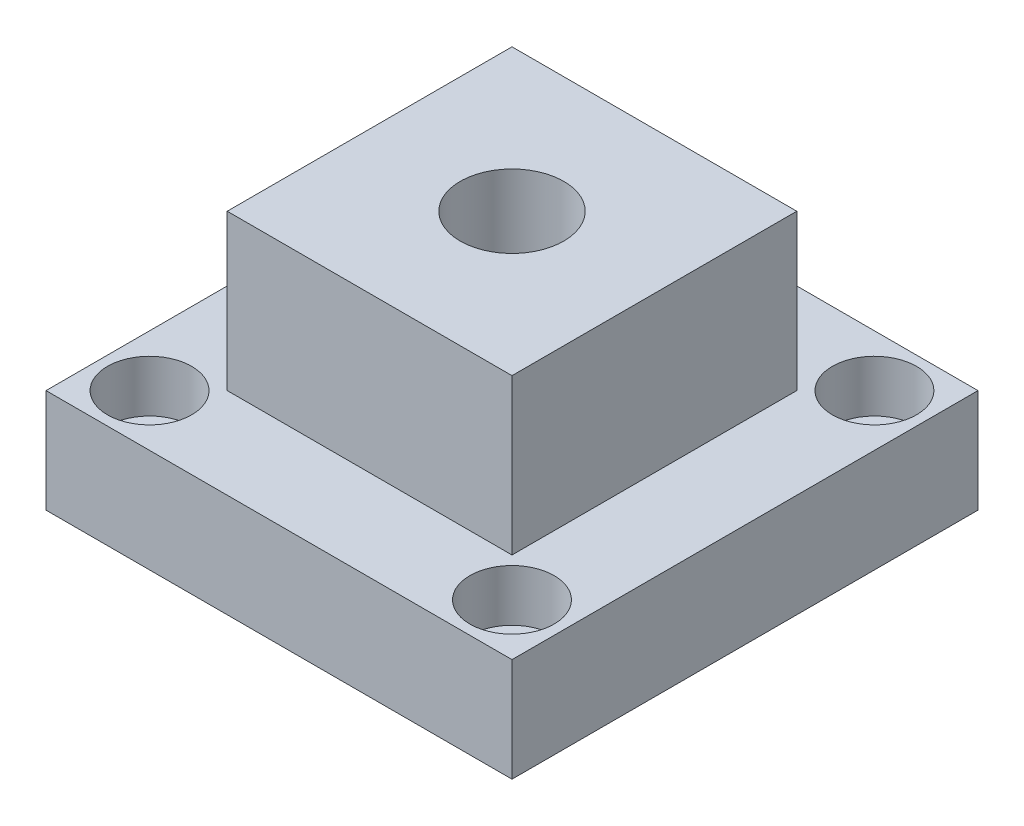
from build123d import *

# Parameters (mm, degrees)
SKETCH1_W                                     = 114.3
SKETCH1_H                                     = 114.3
EXTRUDE1_DEPTH                                = 25.4
CBORE_FOR_1_2_SOCKET_HEAD_CAP_SCREW1_AT_COUNT = 2
CBORE_FOR_1_2_SOCKET_HEAD_CAP_SCREW1_AT_PITCH = 88.9
CBORE_FOR_1_2_SOCKET_HEAD_CAP_SCREW1_2_COUNT  = 2
CBORE_FOR_1_2_SOCKET_HEAD_CAP_SCREW1_2_PITCH  = 88.9
CBORE_FOR_1_2_SOCKET_HEAD_CAP_SCREW1_3_COUNT  = 2
CBORE_FOR_1_2_SOCKET_HEAD_CAP_SCREW1_3_PITCH  = 125.723585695
SKETCH4_W                                     = 69.85
SKETCH4_H                                     = 69.85
EXTRUDE2_DEPTH                                = 38.1
F_1_12_TAPPED_HOLE1_D                         = 23.41626
F_1_12_TAPPED_HOLE1_DEPTH                     = 31.74746
F_1_12_TAPPED_HOLE1_CBORE_D                   = 25.4
F_1_12_TAPPED_HOLE1_CBORE_DEPTH               = 25.4
F_1_12_TAPPED_HOLE1_TIP                       = 7.034954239


with BuildPart() as part:
    # Sketch1 → Extrude1 (new body)
    with BuildSketch(Plane(origin=(0, 0, 0), x_dir=(1, 0, 0), z_dir=(0, 1, 0))):
        with Locations((57.15, 57.15)):
            Rectangle(SKETCH1_W, SKETCH1_H)
    extrude(amount=EXTRUDE1_DEPTH)

    # Sketch3 → CBORE for 1_2 Socket Head Cap Screw1 (revolve, cut)
    with BuildSketch(Plane(origin=(12.7, 25.4, -12.7), x_dir=(0, 0, 1), z_dir=(1, 0, 0))):
        Polygon((0, 0), (0, 25.4), (7.58063, 25.4), (6.94563, 24.765), (6.94563, 12.7), (10.31875, 12.7), (10.31875, 0), align=None)
    cbore_for_1_2_socket_head_cap_screw1 = revolve(axis=Axis((12.7, 31.75, -12.7), (0, -1, 0)), mode=Mode.SUBTRACT)

    # CBORE for 1_2 Socket Head Cap Screw1 at: CBORE for 1_2 Socket Head Cap Screw1 ×2
    with Locations(*[(i * CBORE_FOR_1_2_SOCKET_HEAD_CAP_SCREW1_AT_PITCH, 0, 0) for i in range(1, CBORE_FOR_1_2_SOCKET_HEAD_CAP_SCREW1_AT_COUNT)]):
        add(cbore_for_1_2_socket_head_cap_screw1, mode=Mode.SUBTRACT)

    # CBORE for 1_2 Socket Head Cap Screw1 2: CBORE for 1_2 Socket Head Cap Screw1 ×2
    with Locations(*[(0, 0, -i * CBORE_FOR_1_2_SOCKET_HEAD_CAP_SCREW1_2_PITCH) for i in range(1, CBORE_FOR_1_2_SOCKET_HEAD_CAP_SCREW1_2_COUNT)]):
        add(cbore_for_1_2_socket_head_cap_screw1, mode=Mode.SUBTRACT)

    # CBORE for 1_2 Socket Head Cap Screw1 3: CBORE for 1_2 Socket Head Cap Screw1 ×2
    with Locations(*[Vector(0.7071067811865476, 0, -0.7071067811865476) * (i * CBORE_FOR_1_2_SOCKET_HEAD_CAP_SCREW1_3_PITCH) for i in range(1, CBORE_FOR_1_2_SOCKET_HEAD_CAP_SCREW1_3_COUNT)]):
        add(cbore_for_1_2_socket_head_cap_screw1, mode=Mode.SUBTRACT)

    # Sketch4 → Extrude2 (add)
    with BuildSketch(Plane(origin=(0, 25.4, 0), x_dir=(1, 0, 0), z_dir=(0, 1, 0))):
        with Locations((57.15, 57.15)):
            Rectangle(SKETCH4_W, SKETCH4_H)
    extrude(amount=EXTRUDE2_DEPTH)

    # 1-12 Tapped Hole1
    with Locations(Plane(origin=(57.15, 63.5, -57.15), x_dir=(0, 0, 1), z_dir=(0, 1, 0))):
        with Locations((0, 0)):
            CounterBoreHole(F_1_12_TAPPED_HOLE1_D / 2, F_1_12_TAPPED_HOLE1_CBORE_D / 2, F_1_12_TAPPED_HOLE1_CBORE_DEPTH, depth=F_1_12_TAPPED_HOLE1_DEPTH)
            with Locations((0, 0, -(F_1_12_TAPPED_HOLE1_DEPTH + F_1_12_TAPPED_HOLE1_TIP / 2))):  # 118° drill point
                Cone(0, F_1_12_TAPPED_HOLE1_D / 2, F_1_12_TAPPED_HOLE1_TIP, mode=Mode.SUBTRACT)


solid = part.part
